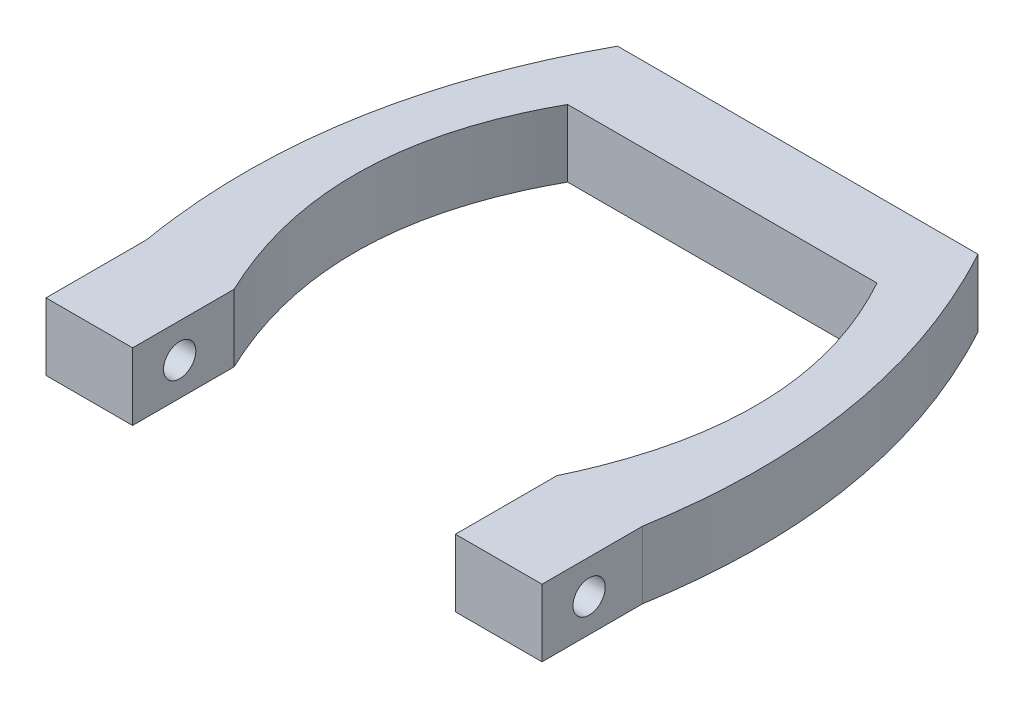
ISO-10303-21;
HEADER;
FILE_DESCRIPTION(('STEP AP214'),'2;1');
FILE_NAME('part.step','',(''),(''),'','','');
FILE_SCHEMA(('AUTOMOTIVE_DESIGN { 1 0 10303 214 1 1 1 1 }'));
ENDSEC;
DATA;
#1=APPLICATION_CONTEXT('core data for automotive mechanical design processes');
#2=APPLICATION_PROTOCOL_DEFINITION('international standard','automotive_design',2000,#1);
#3=PRODUCT_CONTEXT('',#1,'mechanical');
#4=PRODUCT('Part','Part','',(#3));
#5=PRODUCT_RELATED_PRODUCT_CATEGORY('part','',(#4));
#6=PRODUCT_DEFINITION_FORMATION('','',#4);
#7=PRODUCT_DEFINITION_CONTEXT('part definition',#1,'design');
#8=PRODUCT_DEFINITION('design','',#6,#7);
#9=PRODUCT_DEFINITION_SHAPE('','',#8);
#10=(LENGTH_UNIT() NAMED_UNIT(*) SI_UNIT(.MILLI.,.METRE.));
#11=(NAMED_UNIT(*) PLANE_ANGLE_UNIT() SI_UNIT($,.RADIAN.));
#12=(NAMED_UNIT(*) SI_UNIT($,.STERADIAN.) SOLID_ANGLE_UNIT());
#13=UNCERTAINTY_MEASURE_WITH_UNIT(LENGTH_MEASURE(1.E-05),#10,'distance_accuracy_value','');
#14=(GEOMETRIC_REPRESENTATION_CONTEXT(3) GLOBAL_UNCERTAINTY_ASSIGNED_CONTEXT((#13)) GLOBAL_UNIT_ASSIGNED_CONTEXT((#10,
#11,#12)) REPRESENTATION_CONTEXT('',''));
#15=CARTESIAN_POINT('',(0.,0.,0.));
#16=DIRECTION('',(0.,0.,1.));
#17=DIRECTION('',(1.,0.,0.));
#18=AXIS2_PLACEMENT_3D('',#15,#16,#17);
#19=CARTESIAN_POINT('',(-13.9620538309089,5.,12.5715168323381));
#20=CARTESIAN_POINT('',(-19.9816170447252,5.,0.0101359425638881));
#21=CARTESIAN_POINT('',(-13.4614610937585,5.,-11.7241842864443));
#22=B_SPLINE_CURVE_WITH_KNOTS('',2,(#19,#20,#21),.UNSPECIFIED.,.F.,.F.,(3,3),(0.,1.),.UNSPECIFIED.);
#23=DIRECTION('',(0.,-1.,0.));
#24=VECTOR('',#23,1.);
#25=SURFACE_OF_LINEAR_EXTRUSION('',#22,#24);
#26=CARTESIAN_POINT('',(-13.9620538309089,0.,12.5715168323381));
#27=CARTESIAN_POINT('',(-19.9816170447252,0.,0.0101359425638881));
#28=CARTESIAN_POINT('',(-13.4614610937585,0.,-11.7241842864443));
#29=B_SPLINE_CURVE_WITH_KNOTS('',2,(#26,#27,#28),.UNSPECIFIED.,.F.,.F.,(3,3),(0.,1.),.UNSPECIFIED.);
#30=CARTESIAN_POINT('',(-13.9620538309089,0.,12.5715168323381));
#31=VERTEX_POINT('',#30);
#32=CARTESIAN_POINT('',(-13.4614610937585,0.,-11.7241842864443));
#33=VERTEX_POINT('',#32);
#34=EDGE_CURVE('E157',#31,#33,#29,.T.);
#35=ORIENTED_EDGE('',*,*,#34,.T.);
#36=DIRECTION('',(0.,-1.,0.));
#37=VECTOR('',#36,1.);
#38=CARTESIAN_POINT('',(-13.4614610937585,5.,-11.7241842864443));
#39=LINE('',#38,#37);
#40=CARTESIAN_POINT('',(-13.4614610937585,5.,-11.7241842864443));
#41=VERTEX_POINT('',#40);
#42=EDGE_CURVE('E11',#41,#33,#39,.T.);
#43=ORIENTED_EDGE('',*,*,#42,.F.);
#44=CARTESIAN_POINT('',(-13.9620538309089,5.,12.5715168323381));
#45=VERTEX_POINT('',#44);
#46=EDGE_CURVE('E200',#45,#41,#22,.T.);
#47=ORIENTED_EDGE('',*,*,#46,.F.);
#48=DIRECTION('',(0.,-1.,0.));
#49=VECTOR('',#48,1.);
#50=CARTESIAN_POINT('',(-13.9620538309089,5.,12.5715168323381));
#51=LINE('',#50,#49);
#52=EDGE_CURVE('E153',#45,#31,#51,.T.);
#53=ORIENTED_EDGE('',*,*,#52,.T.);
#54=EDGE_LOOP('',(#35,#43,#47,#53));
#55=FACE_BOUND('',#54,.T.);
#56=ADVANCED_FACE('F35',(#55),#25,.F.);
#57=CARTESIAN_POINT('',(-13.4614610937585,5.,-11.7241842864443));
#58=DIRECTION('',(0.,0.,-1.));
#59=DIRECTION('',(-1.,0.,0.));
#60=AXIS2_PLACEMENT_3D('',#57,#58,#59);
#61=PLANE('',#60);
#62=DIRECTION('',(1.,0.,0.));
#63=VECTOR('',#62,1.);
#64=CARTESIAN_POINT('',(-13.4614610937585,0.,-11.7241842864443));
#65=LINE('',#64,#63);
#66=CARTESIAN_POINT('',(9.53853890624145,0.,-11.7241842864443));
#67=VERTEX_POINT('',#66);
#68=EDGE_CURVE('E162',#33,#67,#65,.T.);
#69=ORIENTED_EDGE('',*,*,#68,.T.);
#70=DIRECTION('',(0.,-1.,0.));
#71=VECTOR('',#70,1.);
#72=CARTESIAN_POINT('',(9.53853890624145,5.,-11.7241842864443));
#73=LINE('',#72,#71);
#74=CARTESIAN_POINT('',(9.53853890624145,5.,-11.7241842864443));
#75=VERTEX_POINT('',#74);
#76=EDGE_CURVE('E45',#75,#67,#73,.T.);
#77=ORIENTED_EDGE('',*,*,#76,.F.);
#78=DIRECTION('',(1.,0.,0.));
#79=VECTOR('',#78,1.);
#80=CARTESIAN_POINT('',(-13.4614610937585,5.,-11.7241842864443));
#81=LINE('',#80,#79);
#82=EDGE_CURVE('E108',#41,#75,#81,.T.);
#83=ORIENTED_EDGE('',*,*,#82,.F.);
#84=ORIENTED_EDGE('',*,*,#42,.T.);
#85=EDGE_LOOP('',(#69,#77,#83,#84));
#86=FACE_BOUND('',#85,.T.);
#87=ADVANCED_FACE('F279',(#86),#61,.F.);
#88=CARTESIAN_POINT('',(9.53853890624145,5.,-11.7241842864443));
#89=CARTESIAN_POINT('',(16.0586948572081,5.,0.0101359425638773));
#90=CARTESIAN_POINT('',(10.0391316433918,5.,12.5715168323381));
#91=B_SPLINE_CURVE_WITH_KNOTS('',2,(#88,#89,#90),.UNSPECIFIED.,.F.,.F.,(3,3),(0.,1.),.UNSPECIFIED.);
#92=DIRECTION('',(0.,-1.,0.));
#93=VECTOR('',#92,1.);
#94=SURFACE_OF_LINEAR_EXTRUSION('',#91,#93);
#95=CARTESIAN_POINT('',(9.53853890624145,0.,-11.7241842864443));
#96=CARTESIAN_POINT('',(16.0586948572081,0.,0.0101359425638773));
#97=CARTESIAN_POINT('',(10.0391316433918,0.,12.5715168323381));
#98=B_SPLINE_CURVE_WITH_KNOTS('',2,(#95,#96,#97),.UNSPECIFIED.,.F.,.F.,(3,3),(0.,1.),.UNSPECIFIED.);
#99=CARTESIAN_POINT('',(10.0391316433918,0.,12.5715168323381));
#100=VERTEX_POINT('',#99);
#101=EDGE_CURVE('E168',#67,#100,#98,.T.);
#102=ORIENTED_EDGE('',*,*,#101,.T.);
#103=DIRECTION('',(0.,-1.,0.));
#104=VECTOR('',#103,1.);
#105=CARTESIAN_POINT('',(10.0391316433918,5.,12.5715168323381));
#106=LINE('',#105,#104);
#107=CARTESIAN_POINT('',(10.0391316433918,5.,12.5715168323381));
#108=VERTEX_POINT('',#107);
#109=EDGE_CURVE('E219',#108,#100,#106,.T.);
#110=ORIENTED_EDGE('',*,*,#109,.F.);
#111=EDGE_CURVE('E228',#75,#108,#91,.T.);
#112=ORIENTED_EDGE('',*,*,#111,.F.);
#113=ORIENTED_EDGE('',*,*,#76,.T.);
#114=EDGE_LOOP('',(#102,#110,#112,#113));
#115=FACE_BOUND('',#114,.T.);
#116=ADVANCED_FACE('F226',(#115),#94,.F.);
#117=CARTESIAN_POINT('',(10.0391316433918,5.,20.1172434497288));
#118=DIRECTION('',(1.,0.,0.));
#119=DIRECTION('',(0.,0.,-1.));
#120=AXIS2_PLACEMENT_3D('',#117,#118,#119);
#121=PLANE('',#120);
#122=CARTESIAN_POINT('',(10.0391316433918,2.46036262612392,16.6172434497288));
#123=DIRECTION('',(1.,0.,0.));
#124=DIRECTION('',(0.,0.,-1.));
#125=AXIS2_PLACEMENT_3D('',#122,#123,#124);
#126=CIRCLE('',#125,1.2);
#127=CARTESIAN_POINT('',(10.0391316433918,2.46036262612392,15.4172434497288));
#128=VERTEX_POINT('',#127);
#129=EDGE_CURVE('E163',#128,#128,#126,.T.);
#130=ORIENTED_EDGE('',*,*,#129,.T.);
#131=EDGE_LOOP('',(#130));
#132=FACE_BOUND('',#131,.T.);
#133=DIRECTION('',(0.,0.,1.));
#134=VECTOR('',#133,1.);
#135=CARTESIAN_POINT('',(10.0391316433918,0.,20.1172434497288));
#136=LINE('',#135,#134);
#137=CARTESIAN_POINT('',(10.0391316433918,0.,20.1172434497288));
#138=VERTEX_POINT('',#137);
#139=EDGE_CURVE('E172',#100,#138,#136,.T.);
#140=ORIENTED_EDGE('',*,*,#139,.T.);
#141=DIRECTION('',(0.,-1.,0.));
#142=VECTOR('',#141,1.);
#143=CARTESIAN_POINT('',(10.0391316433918,5.,20.1172434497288));
#144=LINE('',#143,#142);
#145=CARTESIAN_POINT('',(10.0391316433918,5.,20.1172434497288));
#146=VERTEX_POINT('',#145);
#147=EDGE_CURVE('E216',#146,#138,#144,.T.);
#148=ORIENTED_EDGE('',*,*,#147,.F.);
#149=DIRECTION('',(0.,0.,1.));
#150=VECTOR('',#149,1.);
#151=CARTESIAN_POINT('',(10.0391316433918,5.,20.1172434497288));
#152=LINE('',#151,#150);
#153=EDGE_CURVE('E246',#108,#146,#152,.T.);
#154=ORIENTED_EDGE('',*,*,#153,.F.);
#155=ORIENTED_EDGE('',*,*,#109,.T.);
#156=EDGE_LOOP('',(#140,#148,#154,#155));
#157=FACE_BOUND('',#156,.T.);
#158=ADVANCED_FACE('F237',(#132,#157),#121,.F.);
#159=CARTESIAN_POINT('',(16.4768456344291,5.,20.1172434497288));
#160=DIRECTION('',(0.,0.,-1.));
#161=DIRECTION('',(-1.,0.,0.));
#162=AXIS2_PLACEMENT_3D('',#159,#160,#161);
#163=PLANE('',#162);
#164=DIRECTION('',(1.,0.,0.));
#165=VECTOR('',#164,1.);
#166=CARTESIAN_POINT('',(16.4768456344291,0.,20.1172434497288));
#167=LINE('',#166,#165);
#168=CARTESIAN_POINT('',(16.4768456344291,0.,20.1172434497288));
#169=VERTEX_POINT('',#168);
#170=EDGE_CURVE('E177',#138,#169,#167,.T.);
#171=ORIENTED_EDGE('',*,*,#170,.T.);
#172=DIRECTION('',(0.,-1.,0.));
#173=VECTOR('',#172,1.);
#174=CARTESIAN_POINT('',(16.4768456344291,5.,20.1172434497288));
#175=LINE('',#174,#173);
#176=CARTESIAN_POINT('',(16.4768456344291,5.,20.1172434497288));
#177=VERTEX_POINT('',#176);
#178=EDGE_CURVE('E213',#177,#169,#175,.T.);
#179=ORIENTED_EDGE('',*,*,#178,.F.);
#180=DIRECTION('',(1.,0.,0.));
#181=VECTOR('',#180,1.);
#182=CARTESIAN_POINT('',(16.4768456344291,5.,20.1172434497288));
#183=LINE('',#182,#181);
#184=EDGE_CURVE('E243',#146,#177,#183,.T.);
#185=ORIENTED_EDGE('',*,*,#184,.F.);
#186=ORIENTED_EDGE('',*,*,#147,.T.);
#187=EDGE_LOOP('',(#171,#179,#185,#186));
#188=FACE_BOUND('',#187,.T.);
#189=ADVANCED_FACE('F241',(#188),#163,.F.);
#190=CARTESIAN_POINT('',(16.4768456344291,5.,12.6406623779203));
#191=DIRECTION('',(-1.,0.,0.));
#192=DIRECTION('',(0.,0.,1.));
#193=AXIS2_PLACEMENT_3D('',#190,#191,#192);
#194=PLANE('',#193);
#195=CARTESIAN_POINT('',(16.4768456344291,2.46036262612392,16.6172434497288));
#196=DIRECTION('',(-1.,0.,0.));
#197=DIRECTION('',(0.,0.,1.));
#198=AXIS2_PLACEMENT_3D('',#195,#196,#197);
#199=CIRCLE('',#198,1.2);
#200=CARTESIAN_POINT('',(16.4768456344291,2.46036262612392,17.8172434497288));
#201=VERTEX_POINT('',#200);
#202=EDGE_CURVE('E296',#201,#201,#199,.T.);
#203=ORIENTED_EDGE('',*,*,#202,.T.);
#204=EDGE_LOOP('',(#203));
#205=FACE_BOUND('',#204,.T.);
#206=DIRECTION('',(0.,0.,-1.));
#207=VECTOR('',#206,1.);
#208=CARTESIAN_POINT('',(16.4768456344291,0.,12.6406623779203));
#209=LINE('',#208,#207);
#210=CARTESIAN_POINT('',(16.4768456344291,0.,12.6406623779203));
#211=VERTEX_POINT('',#210);
#212=EDGE_CURVE('E179',#169,#211,#209,.T.);
#213=ORIENTED_EDGE('',*,*,#212,.T.);
#214=DIRECTION('',(0.,-1.,0.));
#215=VECTOR('',#214,1.);
#216=CARTESIAN_POINT('',(16.4768456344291,5.,12.6406623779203));
#217=LINE('',#216,#215);
#218=CARTESIAN_POINT('',(16.4768456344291,5.,12.6406623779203));
#219=VERTEX_POINT('',#218);
#220=EDGE_CURVE('E210',#219,#211,#217,.T.);
#221=ORIENTED_EDGE('',*,*,#220,.F.);
#222=DIRECTION('',(0.,0.,-1.));
#223=VECTOR('',#222,1.);
#224=CARTESIAN_POINT('',(16.4768456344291,5.,12.6406623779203));
#225=LINE('',#224,#223);
#226=EDGE_CURVE('E245',#177,#219,#225,.T.);
#227=ORIENTED_EDGE('',*,*,#226,.F.);
#228=ORIENTED_EDGE('',*,*,#178,.T.);
#229=EDGE_LOOP('',(#213,#221,#227,#228));
#230=FACE_BOUND('',#229,.T.);
#231=ADVANCED_FACE('F267',(#205,#230),#194,.F.);
#232=CARTESIAN_POINT('',(16.4768456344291,5.,12.6406623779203));
#233=CARTESIAN_POINT('',(19.1430086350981,5.,-3.1678776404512));
#234=CARTESIAN_POINT('',(11.4355541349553,5.,-17.3367468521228));
#235=B_SPLINE_CURVE_WITH_KNOTS('',2,(#232,#233,#234),.UNSPECIFIED.,.F.,.F.,(3,3),(0.,1.),.UNSPECIFIED.);
#236=DIRECTION('',(0.,-1.,0.));
#237=VECTOR('',#236,1.);
#238=SURFACE_OF_LINEAR_EXTRUSION('',#235,#237);
#239=CARTESIAN_POINT('',(16.4768456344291,0.,12.6406623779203));
#240=CARTESIAN_POINT('',(19.1430086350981,0.,-3.1678776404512));
#241=CARTESIAN_POINT('',(11.4355541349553,0.,-17.3367468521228));
#242=B_SPLINE_CURVE_WITH_KNOTS('',2,(#239,#240,#241),.UNSPECIFIED.,.F.,.F.,(3,3),(0.,1.),.UNSPECIFIED.);
#243=CARTESIAN_POINT('',(11.4355541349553,0.,-17.3367468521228));
#244=VERTEX_POINT('',#243);
#245=EDGE_CURVE('E181',#211,#244,#242,.T.);
#246=ORIENTED_EDGE('',*,*,#245,.T.);
#247=DIRECTION('',(0.,-1.,0.));
#248=VECTOR('',#247,1.);
#249=CARTESIAN_POINT('',(11.4355541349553,5.,-17.3367468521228));
#250=LINE('',#249,#248);
#251=CARTESIAN_POINT('',(11.4355541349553,5.,-17.3367468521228));
#252=VERTEX_POINT('',#251);
#253=EDGE_CURVE('E207',#252,#244,#250,.T.);
#254=ORIENTED_EDGE('',*,*,#253,.F.);
#255=EDGE_CURVE('E248',#219,#252,#235,.T.);
#256=ORIENTED_EDGE('',*,*,#255,.F.);
#257=ORIENTED_EDGE('',*,*,#220,.T.);
#258=EDGE_LOOP('',(#246,#254,#256,#257));
#259=FACE_BOUND('',#258,.T.);
#260=ADVANCED_FACE('F262',(#259),#238,.F.);
#261=CARTESIAN_POINT('',(-15.3584763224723,5.,-17.3367468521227));
#262=DIRECTION('',(0.,0.,1.));
#263=DIRECTION('',(1.,0.,0.));
#264=AXIS2_PLACEMENT_3D('',#261,#262,#263);
#265=PLANE('',#264);
#266=DIRECTION('',(-1.,0.,0.));
#267=VECTOR('',#266,1.);
#268=CARTESIAN_POINT('',(-15.3584763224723,0.,-17.3367468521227));
#269=LINE('',#268,#267);
#270=CARTESIAN_POINT('',(-15.3584763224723,0.,-17.3367468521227));
#271=VERTEX_POINT('',#270);
#272=EDGE_CURVE('E185',#244,#271,#269,.T.);
#273=ORIENTED_EDGE('',*,*,#272,.T.);
#274=DIRECTION('',(0.,-1.,0.));
#275=VECTOR('',#274,1.);
#276=CARTESIAN_POINT('',(-15.3584763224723,5.,-17.3367468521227));
#277=LINE('',#276,#275);
#278=CARTESIAN_POINT('',(-15.3584763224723,5.,-17.3367468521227));
#279=VERTEX_POINT('',#278);
#280=EDGE_CURVE('E204',#279,#271,#277,.T.);
#281=ORIENTED_EDGE('',*,*,#280,.F.);
#282=DIRECTION('',(-1.,0.,0.));
#283=VECTOR('',#282,1.);
#284=CARTESIAN_POINT('',(-15.3584763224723,5.,-17.3367468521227));
#285=LINE('',#284,#283);
#286=EDGE_CURVE('E257',#252,#279,#285,.T.);
#287=ORIENTED_EDGE('',*,*,#286,.F.);
#288=ORIENTED_EDGE('',*,*,#253,.T.);
#289=EDGE_LOOP('',(#273,#281,#287,#288));
#290=FACE_BOUND('',#289,.T.);
#291=ADVANCED_FACE('F266',(#290),#265,.F.);
#292=CARTESIAN_POINT('',(-15.3584763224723,5.,-17.3367468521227));
#293=CARTESIAN_POINT('',(-23.0659308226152,5.,-3.16787764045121));
#294=CARTESIAN_POINT('',(-20.3997678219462,5.,12.6406623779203));
#295=B_SPLINE_CURVE_WITH_KNOTS('',2,(#292,#293,#294),.UNSPECIFIED.,.F.,.F.,(3,3),(0.,1.),.UNSPECIFIED.);
#296=DIRECTION('',(0.,-1.,0.));
#297=VECTOR('',#296,1.);
#298=SURFACE_OF_LINEAR_EXTRUSION('',#295,#297);
#299=CARTESIAN_POINT('',(-15.3584763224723,0.,-17.3367468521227));
#300=CARTESIAN_POINT('',(-23.0659308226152,0.,-3.16787764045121));
#301=CARTESIAN_POINT('',(-20.3997678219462,0.,12.6406623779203));
#302=B_SPLINE_CURVE_WITH_KNOTS('',2,(#299,#300,#301),.UNSPECIFIED.,.F.,.F.,(3,3),(0.,1.),.UNSPECIFIED.);
#303=CARTESIAN_POINT('',(-20.3997678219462,0.,12.6406623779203));
#304=VERTEX_POINT('',#303);
#305=EDGE_CURVE('E190',#271,#304,#302,.T.);
#306=ORIENTED_EDGE('',*,*,#305,.T.);
#307=DIRECTION('',(0.,-1.,0.));
#308=VECTOR('',#307,1.);
#309=CARTESIAN_POINT('',(-20.3997678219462,5.,12.6406623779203));
#310=LINE('',#309,#308);
#311=CARTESIAN_POINT('',(-20.3997678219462,5.,12.6406623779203));
#312=VERTEX_POINT('',#311);
#313=EDGE_CURVE('E148',#312,#304,#310,.T.);
#314=ORIENTED_EDGE('',*,*,#313,.F.);
#315=EDGE_CURVE('E139',#279,#312,#295,.T.);
#316=ORIENTED_EDGE('',*,*,#315,.F.);
#317=ORIENTED_EDGE('',*,*,#280,.T.);
#318=EDGE_LOOP('',(#306,#314,#316,#317));
#319=FACE_BOUND('',#318,.T.);
#320=ADVANCED_FACE('F330',(#319),#298,.F.);
#321=CARTESIAN_POINT('',(-20.3997678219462,5.,12.6406623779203));
#322=DIRECTION('',(1.,0.,0.));
#323=DIRECTION('',(0.,0.,-1.));
#324=AXIS2_PLACEMENT_3D('',#321,#322,#323);
#325=PLANE('',#324);
#326=CARTESIAN_POINT('',(-20.3997678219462,2.46036262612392,16.6172434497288));
#327=DIRECTION('',(-1.,0.,0.));
#328=DIRECTION('',(0.,0.,1.));
#329=AXIS2_PLACEMENT_3D('',#326,#327,#328);
#330=CIRCLE('',#329,1.2);
#331=CARTESIAN_POINT('',(-20.3997678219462,2.46036262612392,17.8172434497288));
#332=VERTEX_POINT('',#331);
#333=EDGE_CURVE('E299',#332,#332,#330,.T.);
#334=ORIENTED_EDGE('',*,*,#333,.F.);
#335=EDGE_LOOP('',(#334));
#336=FACE_BOUND('',#335,.T.);
#337=DIRECTION('',(0.,0.,1.));
#338=VECTOR('',#337,1.);
#339=CARTESIAN_POINT('',(-20.3997678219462,0.,12.6406623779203));
#340=LINE('',#339,#338);
#341=CARTESIAN_POINT('',(-20.3997678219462,0.,20.1172434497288));
#342=VERTEX_POINT('',#341);
#343=EDGE_CURVE('E147',#304,#342,#340,.T.);
#344=ORIENTED_EDGE('',*,*,#343,.T.);
#345=DIRECTION('',(0.,-1.,0.));
#346=VECTOR('',#345,1.);
#347=CARTESIAN_POINT('',(-20.3997678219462,5.,20.1172434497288));
#348=LINE('',#347,#346);
#349=CARTESIAN_POINT('',(-20.3997678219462,5.,20.1172434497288));
#350=VERTEX_POINT('',#349);
#351=EDGE_CURVE('E144',#350,#342,#348,.T.);
#352=ORIENTED_EDGE('',*,*,#351,.F.);
#353=DIRECTION('',(0.,0.,1.));
#354=VECTOR('',#353,1.);
#355=CARTESIAN_POINT('',(-20.3997678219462,5.,12.6406623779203));
#356=LINE('',#355,#354);
#357=EDGE_CURVE('E133',#312,#350,#356,.T.);
#358=ORIENTED_EDGE('',*,*,#357,.F.);
#359=ORIENTED_EDGE('',*,*,#313,.T.);
#360=EDGE_LOOP('',(#344,#352,#358,#359));
#361=FACE_BOUND('',#360,.T.);
#362=ADVANCED_FACE('F145',(#336,#361),#325,.F.);
#363=CARTESIAN_POINT('',(-20.3997678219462,5.,20.1172434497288));
#364=DIRECTION('',(0.,0.,-1.));
#365=DIRECTION('',(-1.,0.,0.));
#366=AXIS2_PLACEMENT_3D('',#363,#364,#365);
#367=PLANE('',#366);
#368=DIRECTION('',(1.,0.,0.));
#369=VECTOR('',#368,1.);
#370=CARTESIAN_POINT('',(-20.3997678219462,0.,20.1172434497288));
#371=LINE('',#370,#369);
#372=CARTESIAN_POINT('',(-13.9620538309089,0.,20.1172434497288));
#373=VERTEX_POINT('',#372);
#374=EDGE_CURVE('E94',#342,#373,#371,.T.);
#375=ORIENTED_EDGE('',*,*,#374,.T.);
#376=DIRECTION('',(0.,-1.,0.));
#377=VECTOR('',#376,1.);
#378=CARTESIAN_POINT('',(-13.9620538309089,5.,20.1172434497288));
#379=LINE('',#378,#377);
#380=CARTESIAN_POINT('',(-13.9620538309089,5.,20.1172434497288));
#381=VERTEX_POINT('',#380);
#382=EDGE_CURVE('E149',#381,#373,#379,.T.);
#383=ORIENTED_EDGE('',*,*,#382,.F.);
#384=DIRECTION('',(1.,0.,0.));
#385=VECTOR('',#384,1.);
#386=CARTESIAN_POINT('',(-20.3997678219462,5.,20.1172434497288));
#387=LINE('',#386,#385);
#388=EDGE_CURVE('E137',#350,#381,#387,.T.);
#389=ORIENTED_EDGE('',*,*,#388,.F.);
#390=ORIENTED_EDGE('',*,*,#351,.T.);
#391=EDGE_LOOP('',(#375,#383,#389,#390));
#392=FACE_BOUND('',#391,.T.);
#393=ADVANCED_FACE('F151',(#392),#367,.F.);
#394=CARTESIAN_POINT('',(-13.9620538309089,5.,20.1172434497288));
#395=DIRECTION('',(-1.,0.,0.));
#396=DIRECTION('',(0.,0.,1.));
#397=AXIS2_PLACEMENT_3D('',#394,#395,#396);
#398=PLANE('',#397);
#399=CARTESIAN_POINT('',(-13.9620538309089,2.46036262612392,16.6172434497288));
#400=DIRECTION('',(-1.,0.,0.));
#401=DIRECTION('',(0.,0.,1.));
#402=AXIS2_PLACEMENT_3D('',#399,#400,#401);
#403=CIRCLE('',#402,1.2);
#404=CARTESIAN_POINT('',(-13.9620538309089,2.46036262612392,17.8172434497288));
#405=VERTEX_POINT('',#404);
#406=EDGE_CURVE('E39',#405,#405,#403,.T.);
#407=ORIENTED_EDGE('',*,*,#406,.T.);
#408=EDGE_LOOP('',(#407));
#409=FACE_BOUND('',#408,.T.);
#410=DIRECTION('',(0.,0.,-1.));
#411=VECTOR('',#410,1.);
#412=CARTESIAN_POINT('',(-13.9620538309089,0.,20.1172434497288));
#413=LINE('',#412,#411);
#414=EDGE_CURVE('E100',#373,#31,#413,.T.);
#415=ORIENTED_EDGE('',*,*,#414,.T.);
#416=ORIENTED_EDGE('',*,*,#52,.F.);
#417=DIRECTION('',(0.,0.,-1.));
#418=VECTOR('',#417,1.);
#419=CARTESIAN_POINT('',(-13.9620538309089,5.,20.1172434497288));
#420=LINE('',#419,#418);
#421=EDGE_CURVE('E53',#381,#45,#420,.T.);
#422=ORIENTED_EDGE('',*,*,#421,.F.);
#423=ORIENTED_EDGE('',*,*,#382,.T.);
#424=EDGE_LOOP('',(#415,#416,#422,#423));
#425=FACE_BOUND('',#424,.T.);
#426=ADVANCED_FACE('F306',(#409,#425),#398,.F.);
#427=CARTESIAN_POINT('',(-16.8466872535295,5.,0.216901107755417));
#428=DIRECTION('',(0.,1.,0.));
#429=DIRECTION('',(0.,0.,1.));
#430=AXIS2_PLACEMENT_3D('',#427,#428,#429);
#431=PLANE('',#430);
#432=ORIENTED_EDGE('',*,*,#46,.T.);
#433=ORIENTED_EDGE('',*,*,#82,.T.);
#434=ORIENTED_EDGE('',*,*,#111,.T.);
#435=ORIENTED_EDGE('',*,*,#153,.T.);
#436=ORIENTED_EDGE('',*,*,#184,.T.);
#437=ORIENTED_EDGE('',*,*,#226,.T.);
#438=ORIENTED_EDGE('',*,*,#255,.T.);
#439=ORIENTED_EDGE('',*,*,#286,.T.);
#440=ORIENTED_EDGE('',*,*,#315,.T.);
#441=ORIENTED_EDGE('',*,*,#357,.T.);
#442=ORIENTED_EDGE('',*,*,#388,.T.);
#443=ORIENTED_EDGE('',*,*,#421,.T.);
#444=EDGE_LOOP('',(#432,#433,#434,#435,#436,#437,#438,#439,#440,#441,#442,#443));
#445=FACE_BOUND('',#444,.T.);
#446=ADVANCED_FACE('F135',(#445),#431,.T.);
#447=CARTESIAN_POINT('',(-16.8466872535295,0.,0.216901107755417));
#448=DIRECTION('',(0.,1.,0.));
#449=DIRECTION('',(0.,0.,1.));
#450=AXIS2_PLACEMENT_3D('',#447,#448,#449);
#451=PLANE('',#450);
#452=ORIENTED_EDGE('',*,*,#34,.F.);
#453=ORIENTED_EDGE('',*,*,#414,.F.);
#454=ORIENTED_EDGE('',*,*,#374,.F.);
#455=ORIENTED_EDGE('',*,*,#343,.F.);
#456=ORIENTED_EDGE('',*,*,#305,.F.);
#457=ORIENTED_EDGE('',*,*,#272,.F.);
#458=ORIENTED_EDGE('',*,*,#245,.F.);
#459=ORIENTED_EDGE('',*,*,#212,.F.);
#460=ORIENTED_EDGE('',*,*,#170,.F.);
#461=ORIENTED_EDGE('',*,*,#139,.F.);
#462=ORIENTED_EDGE('',*,*,#101,.F.);
#463=ORIENTED_EDGE('',*,*,#68,.F.);
#464=EDGE_LOOP('',(#452,#453,#454,#455,#456,#457,#458,#459,#460,#461,#462,#463));
#465=FACE_BOUND('',#464,.T.);
#466=ADVANCED_FACE('F232',(#465),#451,.F.);
#467=CARTESIAN_POINT('',(17.6002321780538,2.46036262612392,16.6172434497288));
#468=DIRECTION('',(-1.,0.,0.));
#469=DIRECTION('',(0.,0.,1.));
#470=AXIS2_PLACEMENT_3D('',#467,#468,#469);
#471=CYLINDRICAL_SURFACE('',#470,1.2);
#472=ORIENTED_EDGE('',*,*,#333,.T.);
#473=EDGE_LOOP('',(#472));
#474=FACE_BOUND('',#473,.T.);
#475=ORIENTED_EDGE('',*,*,#406,.F.);
#476=EDGE_LOOP('',(#475));
#477=FACE_BOUND('',#476,.T.);
#478=ADVANCED_FACE('F308',(#474,#477),#471,.F.);
#479=ORIENTED_EDGE('',*,*,#202,.F.);
#480=EDGE_LOOP('',(#479));
#481=FACE_BOUND('',#480,.T.);
#482=ORIENTED_EDGE('',*,*,#129,.F.);
#483=EDGE_LOOP('',(#482));
#484=FACE_BOUND('',#483,.T.);
#485=ADVANCED_FACE('F310',(#481,#484),#471,.F.);
#486=CLOSED_SHELL('',(#56,#87,#116,#158,#189,#231,#260,#291,#320,#362,#393,#426,#446,#466,#478,#485));
#487=MANIFOLD_SOLID_BREP('B2',#486);
#488=ADVANCED_BREP_SHAPE_REPRESENTATION('',(#18,#487),#14);
#489=SHAPE_DEFINITION_REPRESENTATION(#9,#488);
ENDSEC;
END-ISO-10303-21;
